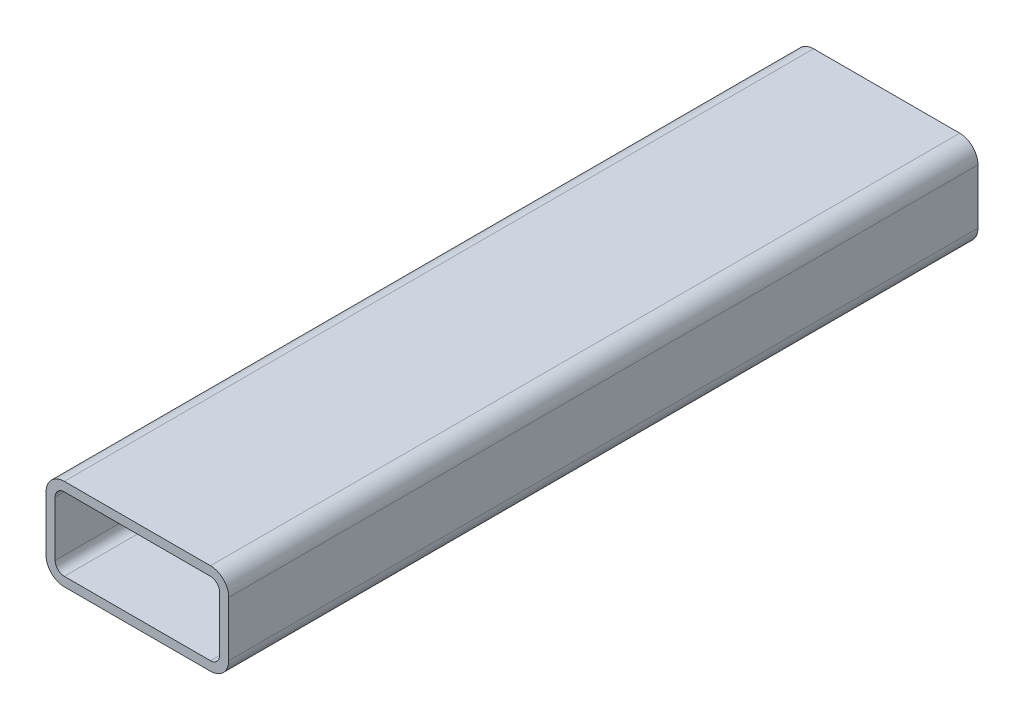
ISO-10303-21;
HEADER;
FILE_DESCRIPTION(('STEP AP214'),'2;1');
FILE_NAME('part.step','',(''),(''),'','','');
FILE_SCHEMA(('AUTOMOTIVE_DESIGN { 1 0 10303 214 1 1 1 1 }'));
ENDSEC;
DATA;
#1=APPLICATION_CONTEXT('core data for automotive mechanical design processes');
#2=APPLICATION_PROTOCOL_DEFINITION('international standard','automotive_design',2000,#1);
#3=PRODUCT_CONTEXT('',#1,'mechanical');
#4=PRODUCT('Part','Part','',(#3));
#5=PRODUCT_RELATED_PRODUCT_CATEGORY('part','',(#4));
#6=PRODUCT_DEFINITION_FORMATION('','',#4);
#7=PRODUCT_DEFINITION_CONTEXT('part definition',#1,'design');
#8=PRODUCT_DEFINITION('design','',#6,#7);
#9=PRODUCT_DEFINITION_SHAPE('','',#8);
#10=(LENGTH_UNIT() NAMED_UNIT(*) SI_UNIT(.MILLI.,.METRE.));
#11=(NAMED_UNIT(*) PLANE_ANGLE_UNIT() SI_UNIT($,.RADIAN.));
#12=(NAMED_UNIT(*) SI_UNIT($,.STERADIAN.) SOLID_ANGLE_UNIT());
#13=UNCERTAINTY_MEASURE_WITH_UNIT(LENGTH_MEASURE(1.E-05),#10,'distance_accuracy_value','');
#14=(GEOMETRIC_REPRESENTATION_CONTEXT(3) GLOBAL_UNCERTAINTY_ASSIGNED_CONTEXT((#13)) GLOBAL_UNIT_ASSIGNED_CONTEXT((#10,
#11,#12)) REPRESENTATION_CONTEXT('',''));
#15=CARTESIAN_POINT('',(0.,0.,0.));
#16=DIRECTION('',(0.,0.,1.));
#17=DIRECTION('',(1.,0.,0.));
#18=AXIS2_PLACEMENT_3D('',#15,#16,#17);
#19=CARTESIAN_POINT('',(12.0000000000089,12.0000000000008,246.000000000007));
#20=DIRECTION('',(0.,0.,1.00000000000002));
#21=DIRECTION('',(1.00000000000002,0.,0.));
#22=AXIS2_PLACEMENT_3D('',#19,#20,#21);
#23=PLANE('',#22);
#24=CARTESIAN_POINT('',(12.0000000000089,12.0000000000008,246.000000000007));
#25=DIRECTION('',(0.,0.,1.00000000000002));
#26=DIRECTION('',(1.00000000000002,0.,0.));
#27=AXIS2_PLACEMENT_3D('',#24,#25,#26);
#28=CIRCLE('',#27,12.);
#29=CARTESIAN_POINT('',(4.44089209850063E-12,12.0000000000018,246.000000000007));
#30=VERTEX_POINT('',#29);
#31=CARTESIAN_POINT('',(12.0000000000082,2.58126853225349E-12,246.000000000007));
#32=VERTEX_POINT('',#31);
#33=EDGE_CURVE('E225',#30,#32,#28,.T.);
#34=ORIENTED_EDGE('',*,*,#33,.T.);
#35=DIRECTION('',(1.00000000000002,0.,0.));
#36=VECTOR('',#35,1.);
#37=CARTESIAN_POINT('',(12.0000000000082,2.58126853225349E-12,246.000000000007));
#38=LINE('',#37,#36);
#39=CARTESIAN_POINT('',(108.,1.36175792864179E-13,246.));
#40=VERTEX_POINT('',#39);
#41=EDGE_CURVE('E228',#32,#40,#38,.T.);
#42=ORIENTED_EDGE('',*,*,#41,.T.);
#43=CARTESIAN_POINT('',(108.000000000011,12.0000000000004,246.000000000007));
#44=DIRECTION('',(0.,0.,1.00000000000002));
#45=DIRECTION('',(1.00000000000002,0.,0.));
#46=AXIS2_PLACEMENT_3D('',#43,#44,#45);
#47=CIRCLE('',#46,12.);
#48=CARTESIAN_POINT('',(120.000000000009,12.0000000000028,246.000000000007));
#49=VERTEX_POINT('',#48);
#50=EDGE_CURVE('E230',#40,#49,#47,.T.);
#51=ORIENTED_EDGE('',*,*,#50,.T.);
#52=DIRECTION('',(0.,1.00000000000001,0.));
#53=VECTOR('',#52,1.);
#54=CARTESIAN_POINT('',(120.000000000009,12.0000000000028,246.000000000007));
#55=LINE('',#54,#53);
#56=CARTESIAN_POINT('',(120.000000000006,48.0000000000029,246.000000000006));
#57=VERTEX_POINT('',#56);
#58=EDGE_CURVE('E232',#49,#57,#55,.T.);
#59=ORIENTED_EDGE('',*,*,#58,.T.);
#60=CARTESIAN_POINT('',(108.000000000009,48.0000000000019,246.000000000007));
#61=DIRECTION('',(0.,0.,1.00000000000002));
#62=DIRECTION('',(1.00000000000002,0.,0.));
#63=AXIS2_PLACEMENT_3D('',#60,#61,#62);
#64=CIRCLE('',#63,12.);
#65=CARTESIAN_POINT('',(108.000000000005,60.0000000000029,246.000000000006));
#66=VERTEX_POINT('',#65);
#67=EDGE_CURVE('E234',#57,#66,#64,.T.);
#68=ORIENTED_EDGE('',*,*,#67,.T.);
#69=DIRECTION('',(-1.00000000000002,0.,0.));
#70=VECTOR('',#69,1.);
#71=CARTESIAN_POINT('',(108.000000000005,60.0000000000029,246.000000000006));
#72=LINE('',#71,#70);
#73=CARTESIAN_POINT('',(12.0000000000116,60.0000000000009,246.000000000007));
#74=VERTEX_POINT('',#73);
#75=EDGE_CURVE('E236',#66,#74,#72,.T.);
#76=ORIENTED_EDGE('',*,*,#75,.T.);
#77=CARTESIAN_POINT('',(12.0000000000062,48.0000000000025,246.000000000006));
#78=DIRECTION('',(0.,0.,1.00000000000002));
#79=DIRECTION('',(1.00000000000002,0.,0.));
#80=AXIS2_PLACEMENT_3D('',#77,#78,#79);
#81=CIRCLE('',#80,12.);
#82=CARTESIAN_POINT('',(0.,48.0000000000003,246.));
#83=VERTEX_POINT('',#82);
#84=EDGE_CURVE('E238',#74,#83,#81,.T.);
#85=ORIENTED_EDGE('',*,*,#84,.T.);
#86=DIRECTION('',(0.,-1.00000000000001,0.));
#87=VECTOR('',#86,1.);
#88=CARTESIAN_POINT('',(0.,48.0000000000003,246.));
#89=LINE('',#88,#87);
#90=EDGE_CURVE('E240',#83,#30,#89,.T.);
#91=ORIENTED_EDGE('',*,*,#90,.T.);
#92=EDGE_LOOP('',(#34,#42,#51,#59,#68,#76,#85,#91));
#93=FACE_BOUND('',#92,.T.);
#94=DIRECTION('',(1.00000000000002,0.,0.));
#95=VECTOR('',#94,1.);
#96=CARTESIAN_POINT('',(12.0000000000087,6.00000000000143,246.000000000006));
#97=LINE('',#96,#95);
#98=CARTESIAN_POINT('',(12.0000000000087,6.00000000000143,246.000000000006));
#99=VERTEX_POINT('',#98);
#100=CARTESIAN_POINT('',(108.000000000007,6.00000000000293,246.000000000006));
#101=VERTEX_POINT('',#100);
#102=EDGE_CURVE('E183',#99,#101,#97,.T.);
#103=ORIENTED_EDGE('',*,*,#102,.F.);
#104=CARTESIAN_POINT('',(12.0000000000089,12.0000000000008,246.000000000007));
#105=DIRECTION('',(0.,0.,1.00000000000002));
#106=DIRECTION('',(1.00000000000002,0.,0.));
#107=AXIS2_PLACEMENT_3D('',#104,#105,#106);
#108=CIRCLE('',#107,6.);
#109=CARTESIAN_POINT('',(6.00000000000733,12.000000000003,246.000000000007));
#110=VERTEX_POINT('',#109);
#111=EDGE_CURVE('E160',#110,#99,#108,.T.);
#112=ORIENTED_EDGE('',*,*,#111,.F.);
#113=DIRECTION('',(0.,-1.00000000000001,0.));
#114=VECTOR('',#113,1.);
#115=CARTESIAN_POINT('',(6.00000000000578,48.0000000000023,246.000000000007));
#116=LINE('',#115,#114);
#117=CARTESIAN_POINT('',(6.00000000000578,48.0000000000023,246.000000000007));
#118=VERTEX_POINT('',#117);
#119=EDGE_CURVE('E195',#118,#110,#116,.T.);
#120=ORIENTED_EDGE('',*,*,#119,.F.);
#121=CARTESIAN_POINT('',(12.0000000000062,48.0000000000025,246.000000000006));
#122=DIRECTION('',(0.,0.,1.00000000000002));
#123=DIRECTION('',(1.00000000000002,0.,0.));
#124=AXIS2_PLACEMENT_3D('',#121,#122,#123);
#125=CIRCLE('',#124,6.);
#126=CARTESIAN_POINT('',(12.0000000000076,54.0000000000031,246.000000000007));
#127=VERTEX_POINT('',#126);
#128=EDGE_CURVE('E193',#127,#118,#125,.T.);
#129=ORIENTED_EDGE('',*,*,#128,.F.);
#130=DIRECTION('',(-1.00000000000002,0.,0.));
#131=VECTOR('',#130,1.);
#132=CARTESIAN_POINT('',(108.000000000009,54.0000000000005,246.000000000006));
#133=LINE('',#132,#131);
#134=CARTESIAN_POINT('',(108.000000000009,54.0000000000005,246.000000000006));
#135=VERTEX_POINT('',#134);
#136=EDGE_CURVE('E191',#135,#127,#133,.T.);
#137=ORIENTED_EDGE('',*,*,#136,.F.);
#138=CARTESIAN_POINT('',(108.000000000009,48.0000000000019,246.000000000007));
#139=DIRECTION('',(0.,0.,1.00000000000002));
#140=DIRECTION('',(1.00000000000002,0.,0.));
#141=AXIS2_PLACEMENT_3D('',#138,#139,#140);
#142=CIRCLE('',#141,6.00000000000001);
#143=CARTESIAN_POINT('',(114.000000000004,48.0000000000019,246.000000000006));
#144=VERTEX_POINT('',#143);
#145=EDGE_CURVE('E189',#144,#135,#142,.T.);
#146=ORIENTED_EDGE('',*,*,#145,.F.);
#147=DIRECTION('',(0.,1.00000000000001,0.));
#148=VECTOR('',#147,1.);
#149=CARTESIAN_POINT('',(114.000000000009,12.0000000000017,246.000000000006));
#150=LINE('',#149,#148);
#151=CARTESIAN_POINT('',(114.000000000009,12.0000000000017,246.000000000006));
#152=VERTEX_POINT('',#151);
#153=EDGE_CURVE('E187',#152,#144,#150,.T.);
#154=ORIENTED_EDGE('',*,*,#153,.F.);
#155=CARTESIAN_POINT('',(108.000000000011,12.0000000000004,246.000000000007));
#156=DIRECTION('',(0.,0.,1.00000000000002));
#157=DIRECTION('',(1.00000000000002,0.,0.));
#158=AXIS2_PLACEMENT_3D('',#155,#156,#157);
#159=CIRCLE('',#158,6.00000000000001);
#160=EDGE_CURVE('E185',#101,#152,#159,.T.);
#161=ORIENTED_EDGE('',*,*,#160,.F.);
#162=EDGE_LOOP('',(#103,#112,#120,#129,#137,#146,#154,#161));
#163=FACE_BOUND('',#162,.T.);
#164=ADVANCED_FACE('F32',(#93,#163),#23,.T.);
#165=CARTESIAN_POINT('',(12.0000000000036,11.9999999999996,-246.000000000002));
#166=DIRECTION('',(0.,0.,1.00000000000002));
#167=DIRECTION('',(1.00000000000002,0.,0.));
#168=AXIS2_PLACEMENT_3D('',#165,#166,#167);
#169=PLANE('',#168);
#170=CARTESIAN_POINT('',(12.0000000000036,11.9999999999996,-246.000000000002));
#171=DIRECTION('',(0.,0.,1.00000000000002));
#172=DIRECTION('',(1.00000000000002,0.,0.));
#173=AXIS2_PLACEMENT_3D('',#170,#171,#172);
#174=CIRCLE('',#173,12.);
#175=CARTESIAN_POINT('',(5.77315972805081E-12,11.9999999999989,-246.000000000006));
#176=VERTEX_POINT('',#175);
#177=CARTESIAN_POINT('',(12.0000000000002,-3.02535774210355E-12,-246.000000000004));
#178=VERTEX_POINT('',#177);
#179=EDGE_CURVE('E161',#176,#178,#174,.T.);
#180=ORIENTED_EDGE('',*,*,#179,.F.);
#181=DIRECTION('',(0.,-1.00000000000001,0.));
#182=VECTOR('',#181,1.);
#183=CARTESIAN_POINT('',(7.7715611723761E-12,47.9999999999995,-246.000000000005));
#184=LINE('',#183,#182);
#185=CARTESIAN_POINT('',(7.7715611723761E-12,47.9999999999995,-246.000000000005));
#186=VERTEX_POINT('',#185);
#187=EDGE_CURVE('E223',#186,#176,#184,.T.);
#188=ORIENTED_EDGE('',*,*,#187,.F.);
#189=CARTESIAN_POINT('',(12.000000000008,47.9999999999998,-246.000000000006));
#190=DIRECTION('',(0.,0.,1.00000000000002));
#191=DIRECTION('',(1.00000000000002,0.,0.));
#192=AXIS2_PLACEMENT_3D('',#189,#190,#191);
#193=CIRCLE('',#192,12.);
#194=CARTESIAN_POINT('',(12.0000000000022,59.9999999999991,-246.000000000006));
#195=VERTEX_POINT('',#194);
#196=EDGE_CURVE('E221',#195,#186,#193,.T.);
#197=ORIENTED_EDGE('',*,*,#196,.F.);
#198=DIRECTION('',(-1.00000000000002,0.,0.));
#199=VECTOR('',#198,1.);
#200=CARTESIAN_POINT('',(108.000000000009,59.9999999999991,-246.000000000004));
#201=LINE('',#200,#199);
#202=CARTESIAN_POINT('',(108.000000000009,59.9999999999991,-246.000000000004));
#203=VERTEX_POINT('',#202);
#204=EDGE_CURVE('E219',#203,#195,#201,.T.);
#205=ORIENTED_EDGE('',*,*,#204,.F.);
#206=CARTESIAN_POINT('',(108.000000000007,47.9999999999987,-246.000000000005));
#207=DIRECTION('',(0.,0.,1.00000000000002));
#208=DIRECTION('',(1.00000000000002,0.,0.));
#209=AXIS2_PLACEMENT_3D('',#206,#207,#208);
#210=CIRCLE('',#209,12.);
#211=CARTESIAN_POINT('',(120.000000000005,47.9999999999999,-246.000000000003));
#212=VERTEX_POINT('',#211);
#213=EDGE_CURVE('E217',#212,#203,#210,.T.);
#214=ORIENTED_EDGE('',*,*,#213,.F.);
#215=DIRECTION('',(0.,1.00000000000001,0.));
#216=VECTOR('',#215,1.);
#217=CARTESIAN_POINT('',(120.000000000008,11.9999999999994,-246.000000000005));
#218=LINE('',#217,#216);
#219=CARTESIAN_POINT('',(120.000000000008,11.9999999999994,-246.000000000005));
#220=VERTEX_POINT('',#219);
#221=EDGE_CURVE('E215',#220,#212,#218,.T.);
#222=ORIENTED_EDGE('',*,*,#221,.F.);
#223=CARTESIAN_POINT('',(108.000000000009,12.,-246.000000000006));
#224=DIRECTION('',(0.,0.,1.00000000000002));
#225=DIRECTION('',(1.00000000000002,0.,0.));
#226=AXIS2_PLACEMENT_3D('',#223,#224,#225);
#227=CIRCLE('',#226,12.);
#228=CARTESIAN_POINT('',(108.000000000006,-9.15933995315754E-13,-246.000000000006));
#229=VERTEX_POINT('',#228);
#230=EDGE_CURVE('E213',#229,#220,#227,.T.);
#231=ORIENTED_EDGE('',*,*,#230,.F.);
#232=DIRECTION('',(1.00000000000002,0.,0.));
#233=VECTOR('',#232,1.);
#234=CARTESIAN_POINT('',(12.0000000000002,-3.02535774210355E-12,-246.000000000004));
#235=LINE('',#234,#233);
#236=EDGE_CURVE('E211',#178,#229,#235,.T.);
#237=ORIENTED_EDGE('',*,*,#236,.F.);
#238=EDGE_LOOP('',(#180,#188,#197,#205,#214,#222,#231,#237));
#239=FACE_BOUND('',#238,.T.);
#240=CARTESIAN_POINT('',(12.0000000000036,11.9999999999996,-246.000000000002));
#241=DIRECTION('',(0.,0.,1.00000000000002));
#242=DIRECTION('',(1.00000000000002,0.,0.));
#243=AXIS2_PLACEMENT_3D('',#240,#241,#242);
#244=CIRCLE('',#243,6.);
#245=CARTESIAN_POINT('',(6.00000000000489,11.9999999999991,-246.000000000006));
#246=VERTEX_POINT('',#245);
#247=CARTESIAN_POINT('',(12.0000000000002,6.00000000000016,-246.));
#248=VERTEX_POINT('',#247);
#249=EDGE_CURVE('E55',#246,#248,#244,.T.);
#250=ORIENTED_EDGE('',*,*,#249,.T.);
#251=DIRECTION('',(1.00000000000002,0.,0.));
#252=VECTOR('',#251,1.);
#253=CARTESIAN_POINT('',(12.0000000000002,6.00000000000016,-246.));
#254=LINE('',#253,#252);
#255=CARTESIAN_POINT('',(108.000000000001,5.9999999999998,-246.000000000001));
#256=VERTEX_POINT('',#255);
#257=EDGE_CURVE('E147',#248,#256,#254,.T.);
#258=ORIENTED_EDGE('',*,*,#257,.T.);
#259=CARTESIAN_POINT('',(108.000000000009,12.,-246.000000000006));
#260=DIRECTION('',(0.,0.,1.00000000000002));
#261=DIRECTION('',(1.00000000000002,0.,0.));
#262=AXIS2_PLACEMENT_3D('',#259,#260,#261);
#263=CIRCLE('',#262,6.00000000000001);
#264=CARTESIAN_POINT('',(114.000000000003,11.9999999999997,-246.000000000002));
#265=VERTEX_POINT('',#264);
#266=EDGE_CURVE('E156',#256,#265,#263,.T.);
#267=ORIENTED_EDGE('',*,*,#266,.T.);
#268=DIRECTION('',(0.,1.00000000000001,0.));
#269=VECTOR('',#268,1.);
#270=CARTESIAN_POINT('',(114.000000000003,11.9999999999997,-246.000000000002));
#271=LINE('',#270,#269);
#272=CARTESIAN_POINT('',(114.000000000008,47.9999999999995,-246.000000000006));
#273=VERTEX_POINT('',#272);
#274=EDGE_CURVE('E170',#265,#273,#271,.T.);
#275=ORIENTED_EDGE('',*,*,#274,.T.);
#276=CARTESIAN_POINT('',(108.000000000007,47.9999999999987,-246.000000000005));
#277=DIRECTION('',(0.,0.,1.00000000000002));
#278=DIRECTION('',(1.00000000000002,0.,0.));
#279=AXIS2_PLACEMENT_3D('',#276,#277,#278);
#280=CIRCLE('',#279,6.00000000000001);
#281=CARTESIAN_POINT('',(108.000000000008,54.0000000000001,-246.000000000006));
#282=VERTEX_POINT('',#281);
#283=EDGE_CURVE('E173',#273,#282,#280,.T.);
#284=ORIENTED_EDGE('',*,*,#283,.T.);
#285=DIRECTION('',(-1.00000000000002,0.,0.));
#286=VECTOR('',#285,1.);
#287=CARTESIAN_POINT('',(108.000000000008,54.0000000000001,-246.000000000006));
#288=LINE('',#287,#286);
#289=CARTESIAN_POINT('',(12.0000000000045,53.9999999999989,-246.000000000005));
#290=VERTEX_POINT('',#289);
#291=EDGE_CURVE('E176',#282,#290,#288,.T.);
#292=ORIENTED_EDGE('',*,*,#291,.T.);
#293=CARTESIAN_POINT('',(12.000000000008,47.9999999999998,-246.000000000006));
#294=DIRECTION('',(0.,0.,1.00000000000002));
#295=DIRECTION('',(1.00000000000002,0.,0.));
#296=AXIS2_PLACEMENT_3D('',#293,#294,#295);
#297=CIRCLE('',#296,6.);
#298=CARTESIAN_POINT('',(6.00000000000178,47.9999999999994,-246.000000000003));
#299=VERTEX_POINT('',#298);
#300=EDGE_CURVE('E179',#290,#299,#297,.T.);
#301=ORIENTED_EDGE('',*,*,#300,.T.);
#302=DIRECTION('',(0.,-1.00000000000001,0.));
#303=VECTOR('',#302,1.);
#304=CARTESIAN_POINT('',(6.00000000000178,47.9999999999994,-246.000000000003));
#305=LINE('',#304,#303);
#306=EDGE_CURVE('E166',#299,#246,#305,.T.);
#307=ORIENTED_EDGE('',*,*,#306,.T.);
#308=EDGE_LOOP('',(#250,#258,#267,#275,#284,#292,#301,#307));
#309=FACE_BOUND('',#308,.T.);
#310=ADVANCED_FACE('F164',(#239,#309),#169,.F.);
#311=CARTESIAN_POINT('',(12.0000000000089,12.0000000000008,246.000000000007));
#312=DIRECTION('',(0.,0.,-1.00000000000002));
#313=DIRECTION('',(-1.00000000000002,0.,0.));
#314=AXIS2_PLACEMENT_3D('',#311,#312,#313);
#315=CYLINDRICAL_SURFACE('',#314,12.);
#316=ORIENTED_EDGE('',*,*,#179,.T.);
#317=DIRECTION('',(0.,0.,-1.00000000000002));
#318=VECTOR('',#317,1.);
#319=CARTESIAN_POINT('',(12.0000000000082,2.58126853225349E-12,246.000000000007));
#320=LINE('',#319,#318);
#321=EDGE_CURVE('E11',#32,#178,#320,.T.);
#322=ORIENTED_EDGE('',*,*,#321,.F.);
#323=ORIENTED_EDGE('',*,*,#33,.F.);
#324=DIRECTION('',(0.,0.,-1.00000000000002));
#325=VECTOR('',#324,1.);
#326=CARTESIAN_POINT('',(4.44089209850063E-12,12.0000000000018,246.000000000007));
#327=LINE('',#326,#325);
#328=EDGE_CURVE('E242',#30,#176,#327,.T.);
#329=ORIENTED_EDGE('',*,*,#328,.T.);
#330=EDGE_LOOP('',(#316,#322,#323,#329));
#331=FACE_BOUND('',#330,.T.);
#332=ADVANCED_FACE('F34',(#331),#315,.T.);
#333=CARTESIAN_POINT('',(12.0000000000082,2.58126853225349E-12,246.000000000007));
#334=DIRECTION('',(0.,1.00000000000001,0.));
#335=DIRECTION('',(0.,0.,1.00000000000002));
#336=AXIS2_PLACEMENT_3D('',#333,#334,#335);
#337=PLANE('',#336);
#338=ORIENTED_EDGE('',*,*,#236,.T.);
#339=DIRECTION('',(0.,0.,-1.00000000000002));
#340=VECTOR('',#339,1.);
#341=CARTESIAN_POINT('',(108.,1.36175792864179E-13,246.));
#342=LINE('',#341,#340);
#343=EDGE_CURVE('E40',#40,#229,#342,.T.);
#344=ORIENTED_EDGE('',*,*,#343,.F.);
#345=ORIENTED_EDGE('',*,*,#41,.F.);
#346=ORIENTED_EDGE('',*,*,#321,.T.);
#347=EDGE_LOOP('',(#338,#344,#345,#346));
#348=FACE_BOUND('',#347,.T.);
#349=ADVANCED_FACE('F286',(#348),#337,.F.);
#350=CARTESIAN_POINT('',(108.000000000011,12.0000000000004,246.000000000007));
#351=DIRECTION('',(0.,0.,-1.00000000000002));
#352=DIRECTION('',(-1.00000000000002,0.,0.));
#353=AXIS2_PLACEMENT_3D('',#350,#351,#352);
#354=CYLINDRICAL_SURFACE('',#353,12.);
#355=ORIENTED_EDGE('',*,*,#230,.T.);
#356=DIRECTION('',(0.,0.,-1.00000000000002));
#357=VECTOR('',#356,1.);
#358=CARTESIAN_POINT('',(120.000000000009,12.0000000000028,246.000000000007));
#359=LINE('',#358,#357);
#360=EDGE_CURVE('E257',#49,#220,#359,.T.);
#361=ORIENTED_EDGE('',*,*,#360,.F.);
#362=ORIENTED_EDGE('',*,*,#50,.F.);
#363=ORIENTED_EDGE('',*,*,#343,.T.);
#364=EDGE_LOOP('',(#355,#361,#362,#363));
#365=FACE_BOUND('',#364,.T.);
#366=ADVANCED_FACE('F264',(#365),#354,.T.);
#367=CARTESIAN_POINT('',(120.000000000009,12.0000000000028,246.000000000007));
#368=DIRECTION('',(-1.00000000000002,0.,0.));
#369=DIRECTION('',(0.,0.,1.00000000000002));
#370=AXIS2_PLACEMENT_3D('',#367,#368,#369);
#371=PLANE('',#370);
#372=ORIENTED_EDGE('',*,*,#221,.T.);
#373=DIRECTION('',(0.,0.,-1.00000000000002));
#374=VECTOR('',#373,1.);
#375=CARTESIAN_POINT('',(120.000000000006,48.0000000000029,246.000000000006));
#376=LINE('',#375,#374);
#377=EDGE_CURVE('E254',#57,#212,#376,.T.);
#378=ORIENTED_EDGE('',*,*,#377,.F.);
#379=ORIENTED_EDGE('',*,*,#58,.F.);
#380=ORIENTED_EDGE('',*,*,#360,.T.);
#381=EDGE_LOOP('',(#372,#378,#379,#380));
#382=FACE_BOUND('',#381,.T.);
#383=ADVANCED_FACE('F274',(#382),#371,.F.);
#384=CARTESIAN_POINT('',(108.000000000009,48.0000000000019,246.000000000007));
#385=DIRECTION('',(0.,0.,-1.00000000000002));
#386=DIRECTION('',(-1.00000000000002,0.,0.));
#387=AXIS2_PLACEMENT_3D('',#384,#385,#386);
#388=CYLINDRICAL_SURFACE('',#387,12.);
#389=ORIENTED_EDGE('',*,*,#213,.T.);
#390=DIRECTION('',(0.,0.,-1.00000000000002));
#391=VECTOR('',#390,1.);
#392=CARTESIAN_POINT('',(108.000000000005,60.0000000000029,246.000000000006));
#393=LINE('',#392,#391);
#394=EDGE_CURVE('E251',#66,#203,#393,.T.);
#395=ORIENTED_EDGE('',*,*,#394,.F.);
#396=ORIENTED_EDGE('',*,*,#67,.F.);
#397=ORIENTED_EDGE('',*,*,#377,.T.);
#398=EDGE_LOOP('',(#389,#395,#396,#397));
#399=FACE_BOUND('',#398,.T.);
#400=ADVANCED_FACE('F278',(#399),#388,.T.);
#401=CARTESIAN_POINT('',(108.000000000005,60.0000000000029,246.000000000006));
#402=DIRECTION('',(0.,-1.00000000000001,0.));
#403=DIRECTION('',(0.,0.,-1.00000000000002));
#404=AXIS2_PLACEMENT_3D('',#401,#402,#403);
#405=PLANE('',#404);
#406=ORIENTED_EDGE('',*,*,#204,.T.);
#407=DIRECTION('',(0.,0.,-1.00000000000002));
#408=VECTOR('',#407,1.);
#409=CARTESIAN_POINT('',(12.0000000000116,60.0000000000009,246.000000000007));
#410=LINE('',#409,#408);
#411=EDGE_CURVE('E248',#74,#195,#410,.T.);
#412=ORIENTED_EDGE('',*,*,#411,.F.);
#413=ORIENTED_EDGE('',*,*,#75,.F.);
#414=ORIENTED_EDGE('',*,*,#394,.T.);
#415=EDGE_LOOP('',(#406,#412,#413,#414));
#416=FACE_BOUND('',#415,.T.);
#417=ADVANCED_FACE('F299',(#416),#405,.F.);
#418=CARTESIAN_POINT('',(12.0000000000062,48.0000000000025,246.000000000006));
#419=DIRECTION('',(0.,0.,-1.00000000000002));
#420=DIRECTION('',(-1.00000000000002,0.,0.));
#421=AXIS2_PLACEMENT_3D('',#418,#419,#420);
#422=CYLINDRICAL_SURFACE('',#421,12.);
#423=ORIENTED_EDGE('',*,*,#196,.T.);
#424=DIRECTION('',(0.,0.,-1.00000000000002));
#425=VECTOR('',#424,1.);
#426=CARTESIAN_POINT('',(0.,48.0000000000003,246.));
#427=LINE('',#426,#425);
#428=EDGE_CURVE('E245',#83,#186,#427,.T.);
#429=ORIENTED_EDGE('',*,*,#428,.F.);
#430=ORIENTED_EDGE('',*,*,#84,.F.);
#431=ORIENTED_EDGE('',*,*,#411,.T.);
#432=EDGE_LOOP('',(#423,#429,#430,#431));
#433=FACE_BOUND('',#432,.T.);
#434=ADVANCED_FACE('F297',(#433),#422,.T.);
#435=CARTESIAN_POINT('',(0.,48.0000000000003,246.));
#436=DIRECTION('',(1.00000000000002,0.,0.));
#437=DIRECTION('',(0.,0.,-1.00000000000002));
#438=AXIS2_PLACEMENT_3D('',#435,#436,#437);
#439=PLANE('',#438);
#440=ORIENTED_EDGE('',*,*,#187,.T.);
#441=ORIENTED_EDGE('',*,*,#328,.F.);
#442=ORIENTED_EDGE('',*,*,#90,.F.);
#443=ORIENTED_EDGE('',*,*,#428,.T.);
#444=EDGE_LOOP('',(#440,#441,#442,#443));
#445=FACE_BOUND('',#444,.T.);
#446=ADVANCED_FACE('F292',(#445),#439,.F.);
#447=CARTESIAN_POINT('',(12.0000000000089,12.0000000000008,246.000000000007));
#448=DIRECTION('',(0.,0.,-1.00000000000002));
#449=DIRECTION('',(-1.00000000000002,0.,0.));
#450=AXIS2_PLACEMENT_3D('',#447,#448,#449);
#451=CYLINDRICAL_SURFACE('',#450,6.);
#452=ORIENTED_EDGE('',*,*,#249,.F.);
#453=DIRECTION('',(0.,0.,-1.00000000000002));
#454=VECTOR('',#453,1.);
#455=CARTESIAN_POINT('',(6.00000000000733,12.000000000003,246.000000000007));
#456=LINE('',#455,#454);
#457=EDGE_CURVE('E197',#110,#246,#456,.T.);
#458=ORIENTED_EDGE('',*,*,#457,.F.);
#459=ORIENTED_EDGE('',*,*,#111,.T.);
#460=DIRECTION('',(0.,0.,-1.00000000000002));
#461=VECTOR('',#460,1.);
#462=CARTESIAN_POINT('',(12.0000000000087,6.00000000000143,246.000000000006));
#463=LINE('',#462,#461);
#464=EDGE_CURVE('E149',#99,#248,#463,.T.);
#465=ORIENTED_EDGE('',*,*,#464,.T.);
#466=EDGE_LOOP('',(#452,#458,#459,#465));
#467=FACE_BOUND('',#466,.T.);
#468=ADVANCED_FACE('F158',(#467),#451,.F.);
#469=CARTESIAN_POINT('',(12.0000000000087,6.00000000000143,246.000000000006));
#470=DIRECTION('',(0.,1.00000000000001,0.));
#471=DIRECTION('',(0.,0.,1.00000000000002));
#472=AXIS2_PLACEMENT_3D('',#469,#470,#471);
#473=PLANE('',#472);
#474=ORIENTED_EDGE('',*,*,#257,.F.);
#475=ORIENTED_EDGE('',*,*,#464,.F.);
#476=ORIENTED_EDGE('',*,*,#102,.T.);
#477=DIRECTION('',(0.,0.,-1.00000000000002));
#478=VECTOR('',#477,1.);
#479=CARTESIAN_POINT('',(108.000000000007,6.00000000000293,246.000000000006));
#480=LINE('',#479,#478);
#481=EDGE_CURVE('E152',#101,#256,#480,.T.);
#482=ORIENTED_EDGE('',*,*,#481,.T.);
#483=EDGE_LOOP('',(#474,#475,#476,#482));
#484=FACE_BOUND('',#483,.T.);
#485=ADVANCED_FACE('F148',(#484),#473,.T.);
#486=CARTESIAN_POINT('',(108.000000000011,12.0000000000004,246.000000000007));
#487=DIRECTION('',(0.,0.,-1.00000000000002));
#488=DIRECTION('',(-1.00000000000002,0.,0.));
#489=AXIS2_PLACEMENT_3D('',#486,#487,#488);
#490=CYLINDRICAL_SURFACE('',#489,6.00000000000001);
#491=ORIENTED_EDGE('',*,*,#266,.F.);
#492=ORIENTED_EDGE('',*,*,#481,.F.);
#493=ORIENTED_EDGE('',*,*,#160,.T.);
#494=DIRECTION('',(0.,0.,-1.00000000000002));
#495=VECTOR('',#494,1.);
#496=CARTESIAN_POINT('',(114.000000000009,12.0000000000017,246.000000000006));
#497=LINE('',#496,#495);
#498=EDGE_CURVE('E206',#152,#265,#497,.T.);
#499=ORIENTED_EDGE('',*,*,#498,.T.);
#500=EDGE_LOOP('',(#491,#492,#493,#499));
#501=FACE_BOUND('',#500,.T.);
#502=ADVANCED_FACE('F323',(#501),#490,.F.);
#503=CARTESIAN_POINT('',(114.000000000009,12.0000000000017,246.000000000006));
#504=DIRECTION('',(-1.00000000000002,0.,0.));
#505=DIRECTION('',(0.,0.,1.00000000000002));
#506=AXIS2_PLACEMENT_3D('',#503,#504,#505);
#507=PLANE('',#506);
#508=ORIENTED_EDGE('',*,*,#274,.F.);
#509=ORIENTED_EDGE('',*,*,#498,.F.);
#510=ORIENTED_EDGE('',*,*,#153,.T.);
#511=DIRECTION('',(0.,0.,-1.00000000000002));
#512=VECTOR('',#511,1.);
#513=CARTESIAN_POINT('',(114.000000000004,48.0000000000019,246.000000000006));
#514=LINE('',#513,#512);
#515=EDGE_CURVE('E204',#144,#273,#514,.T.);
#516=ORIENTED_EDGE('',*,*,#515,.T.);
#517=EDGE_LOOP('',(#508,#509,#510,#516));
#518=FACE_BOUND('',#517,.T.);
#519=ADVANCED_FACE('F328',(#518),#507,.T.);
#520=CARTESIAN_POINT('',(108.000000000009,48.0000000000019,246.000000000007));
#521=DIRECTION('',(0.,0.,-1.00000000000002));
#522=DIRECTION('',(-1.00000000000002,0.,0.));
#523=AXIS2_PLACEMENT_3D('',#520,#521,#522);
#524=CYLINDRICAL_SURFACE('',#523,6.00000000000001);
#525=ORIENTED_EDGE('',*,*,#283,.F.);
#526=ORIENTED_EDGE('',*,*,#515,.F.);
#527=ORIENTED_EDGE('',*,*,#145,.T.);
#528=DIRECTION('',(0.,0.,-1.00000000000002));
#529=VECTOR('',#528,1.);
#530=CARTESIAN_POINT('',(108.000000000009,54.0000000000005,246.000000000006));
#531=LINE('',#530,#529);
#532=EDGE_CURVE('E202',#135,#282,#531,.T.);
#533=ORIENTED_EDGE('',*,*,#532,.T.);
#534=EDGE_LOOP('',(#525,#526,#527,#533));
#535=FACE_BOUND('',#534,.T.);
#536=ADVANCED_FACE('F332',(#535),#524,.F.);
#537=CARTESIAN_POINT('',(108.000000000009,54.0000000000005,246.000000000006));
#538=DIRECTION('',(0.,-1.00000000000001,0.));
#539=DIRECTION('',(0.,0.,-1.00000000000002));
#540=AXIS2_PLACEMENT_3D('',#537,#538,#539);
#541=PLANE('',#540);
#542=ORIENTED_EDGE('',*,*,#291,.F.);
#543=ORIENTED_EDGE('',*,*,#532,.F.);
#544=ORIENTED_EDGE('',*,*,#136,.T.);
#545=DIRECTION('',(0.,0.,-1.00000000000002));
#546=VECTOR('',#545,1.);
#547=CARTESIAN_POINT('',(12.0000000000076,54.0000000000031,246.000000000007));
#548=LINE('',#547,#546);
#549=EDGE_CURVE('E200',#127,#290,#548,.T.);
#550=ORIENTED_EDGE('',*,*,#549,.T.);
#551=EDGE_LOOP('',(#542,#543,#544,#550));
#552=FACE_BOUND('',#551,.T.);
#553=ADVANCED_FACE('F336',(#552),#541,.T.);
#554=CARTESIAN_POINT('',(12.0000000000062,48.0000000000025,246.000000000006));
#555=DIRECTION('',(0.,0.,-1.00000000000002));
#556=DIRECTION('',(-1.00000000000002,0.,0.));
#557=AXIS2_PLACEMENT_3D('',#554,#555,#556);
#558=CYLINDRICAL_SURFACE('',#557,6.);
#559=ORIENTED_EDGE('',*,*,#300,.F.);
#560=ORIENTED_EDGE('',*,*,#549,.F.);
#561=ORIENTED_EDGE('',*,*,#128,.T.);
#562=DIRECTION('',(0.,0.,-1.00000000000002));
#563=VECTOR('',#562,1.);
#564=CARTESIAN_POINT('',(6.00000000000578,48.0000000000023,246.000000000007));
#565=LINE('',#564,#563);
#566=EDGE_CURVE('E47',#118,#299,#565,.T.);
#567=ORIENTED_EDGE('',*,*,#566,.T.);
#568=EDGE_LOOP('',(#559,#560,#561,#567));
#569=FACE_BOUND('',#568,.T.);
#570=ADVANCED_FACE('F340',(#569),#558,.F.);
#571=CARTESIAN_POINT('',(6.00000000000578,48.0000000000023,246.000000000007));
#572=DIRECTION('',(1.00000000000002,0.,0.));
#573=DIRECTION('',(0.,0.,-1.00000000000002));
#574=AXIS2_PLACEMENT_3D('',#571,#572,#573);
#575=PLANE('',#574);
#576=ORIENTED_EDGE('',*,*,#306,.F.);
#577=ORIENTED_EDGE('',*,*,#566,.F.);
#578=ORIENTED_EDGE('',*,*,#119,.T.);
#579=ORIENTED_EDGE('',*,*,#457,.T.);
#580=EDGE_LOOP('',(#576,#577,#578,#579));
#581=FACE_BOUND('',#580,.T.);
#582=ADVANCED_FACE('F344',(#581),#575,.T.);
#583=CLOSED_SHELL('',(#164,#310,#332,#349,#366,#383,#400,#417,#434,#446,#468,#485,#502,#519,
#536,#553,#570,#582));
#584=MANIFOLD_SOLID_BREP('B2',#583);
#585=ADVANCED_BREP_SHAPE_REPRESENTATION('',(#18,#584),#14);
#586=SHAPE_DEFINITION_REPRESENTATION(#9,#585);
ENDSEC;
END-ISO-10303-21;
